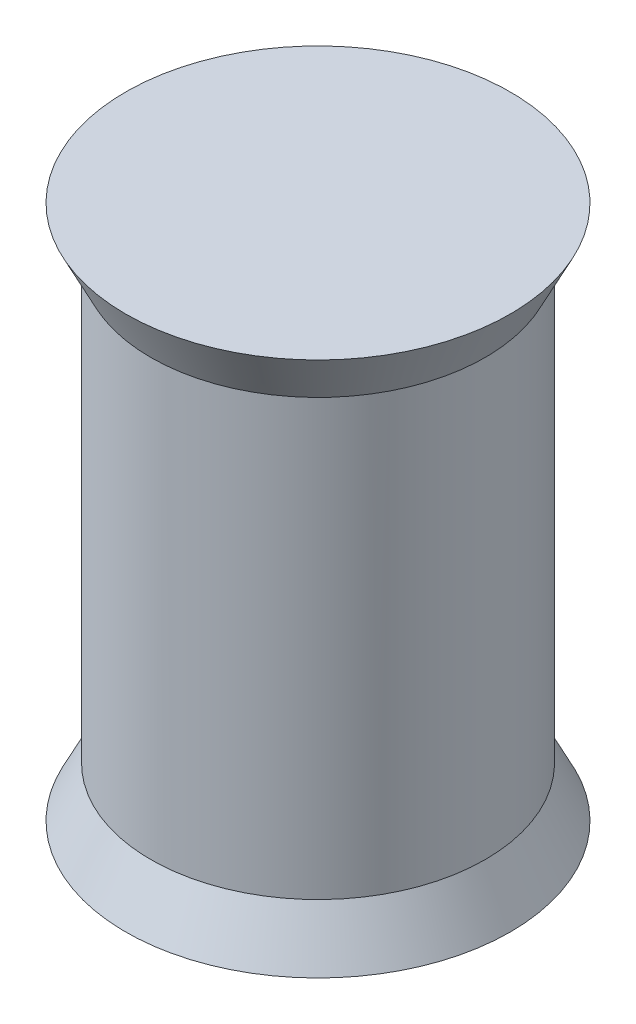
ISO-10303-21;
HEADER;
FILE_DESCRIPTION(('STEP AP214'),'2;1');
FILE_NAME('part.step','',(''),(''),'','','');
FILE_SCHEMA(('AUTOMOTIVE_DESIGN { 1 0 10303 214 1 1 1 1 }'));
ENDSEC;
DATA;
#1=APPLICATION_CONTEXT('core data for automotive mechanical design processes');
#2=APPLICATION_PROTOCOL_DEFINITION('international standard','automotive_design',2000,#1);
#3=PRODUCT_CONTEXT('',#1,'mechanical');
#4=PRODUCT('Part','Part','',(#3));
#5=PRODUCT_RELATED_PRODUCT_CATEGORY('part','',(#4));
#6=PRODUCT_DEFINITION_FORMATION('','',#4);
#7=PRODUCT_DEFINITION_CONTEXT('part definition',#1,'design');
#8=PRODUCT_DEFINITION('design','',#6,#7);
#9=PRODUCT_DEFINITION_SHAPE('','',#8);
#10=(LENGTH_UNIT() NAMED_UNIT(*) SI_UNIT(.MILLI.,.METRE.));
#11=(NAMED_UNIT(*) PLANE_ANGLE_UNIT() SI_UNIT($,.RADIAN.));
#12=(NAMED_UNIT(*) SI_UNIT($,.STERADIAN.) SOLID_ANGLE_UNIT());
#13=UNCERTAINTY_MEASURE_WITH_UNIT(LENGTH_MEASURE(1.E-05),#10,'distance_accuracy_value','');
#14=(GEOMETRIC_REPRESENTATION_CONTEXT(3) GLOBAL_UNCERTAINTY_ASSIGNED_CONTEXT((#13)) GLOBAL_UNIT_ASSIGNED_CONTEXT((#10,
#11,#12)) REPRESENTATION_CONTEXT('',''));
#15=CARTESIAN_POINT('',(0.,0.,0.));
#16=DIRECTION('',(0.,0.,1.));
#17=DIRECTION('',(1.,0.,0.));
#18=AXIS2_PLACEMENT_3D('',#15,#16,#17);
#19=CARTESIAN_POINT('',(-1.4375,4.,0.));
#20=DIRECTION('',(0.,1.,0.));
#21=DIRECTION('',(0.,0.,1.));
#22=AXIS2_PLACEMENT_3D('',#19,#20,#21);
#23=PLANE('',#22);
#24=CARTESIAN_POINT('',(0.,4.00000000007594,0.));
#25=DIRECTION('',(0.,1.,0.));
#26=DIRECTION('',(0.,0.,1.));
#27=AXIS2_PLACEMENT_3D('',#24,#25,#26);
#28=CIRCLE('',#27,2.87499999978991);
#29=CARTESIAN_POINT('',(0.,4.00000000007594,2.87499999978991));
#30=VERTEX_POINT('',#29);
#31=EDGE_CURVE('E17',#30,#30,#28,.F.);
#32=ORIENTED_EDGE('',*,*,#31,.F.);
#33=EDGE_LOOP('',(#32));
#34=FACE_BOUND('',#33,.T.);
#35=ADVANCED_FACE('F14',(#34),#23,.T.);
#36=CARTESIAN_POINT('',(-1.4375,-4.,0.));
#37=DIRECTION('',(0.,-1.,0.));
#38=DIRECTION('',(0.,0.,-1.));
#39=AXIS2_PLACEMENT_3D('',#36,#37,#38);
#40=PLANE('',#39);
#41=CARTESIAN_POINT('',(0.,-4.00000000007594,0.));
#42=DIRECTION('',(0.,-1.,0.));
#43=DIRECTION('',(1.,0.,0.));
#44=AXIS2_PLACEMENT_3D('',#41,#42,#43);
#45=CIRCLE('',#44,2.87499999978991);
#46=CARTESIAN_POINT('',(2.87499999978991,-4.00000000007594,0.));
#47=VERTEX_POINT('',#46);
#48=EDGE_CURVE('E26',#47,#47,#45,.F.);
#49=ORIENTED_EDGE('',*,*,#48,.F.);
#50=EDGE_LOOP('',(#49));
#51=FACE_BOUND('',#50,.T.);
#52=ADVANCED_FACE('F41',(#51),#40,.T.);
#53=CARTESIAN_POINT('',(0.,4.0000000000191,0.));
#54=DIRECTION('',(0.,1.,0.));
#55=DIRECTION('',(0.,0.,1.));
#56=AXIS2_PLACEMENT_3D('',#53,#54,#55);
#57=CONICAL_SURFACE('',#56,2.87499999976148,0.463647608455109);
#58=CARTESIAN_POINT('',(0.,3.25,0.));
#59=DIRECTION('',(0.,1.,0.));
#60=DIRECTION('',(-1.,0.,0.));
#61=AXIS2_PLACEMENT_3D('',#58,#59,#60);
#62=CIRCLE('',#61,2.5);
#63=CARTESIAN_POINT('',(-2.5,3.25,0.));
#64=VERTEX_POINT('',#63);
#65=EDGE_CURVE('E21',#64,#64,#62,.F.);
#66=ORIENTED_EDGE('',*,*,#65,.F.);
#67=EDGE_LOOP('',(#66));
#68=FACE_BOUND('',#67,.T.);
#69=ORIENTED_EDGE('',*,*,#31,.T.);
#70=EDGE_LOOP('',(#69));
#71=FACE_BOUND('',#70,.T.);
#72=ADVANCED_FACE('F38',(#68,#71),#57,.T.);
#73=CARTESIAN_POINT('',(0.,-3.99999999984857,0.));
#74=DIRECTION('',(0.,-1.,0.));
#75=DIRECTION('',(1.,0.,0.));
#76=AXIS2_PLACEMENT_3D('',#73,#74,#75);
#77=CONICAL_SURFACE('',#76,2.87499999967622,0.463647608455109);
#78=ORIENTED_EDGE('',*,*,#48,.T.);
#79=EDGE_LOOP('',(#78));
#80=FACE_BOUND('',#79,.T.);
#81=CARTESIAN_POINT('',(0.,-3.25,0.));
#82=DIRECTION('',(0.,1.,0.));
#83=DIRECTION('',(-1.,0.,0.));
#84=AXIS2_PLACEMENT_3D('',#81,#82,#83);
#85=CIRCLE('',#84,2.5);
#86=CARTESIAN_POINT('',(-2.5,-3.25,0.));
#87=VERTEX_POINT('',#86);
#88=EDGE_CURVE('E10',#87,#87,#85,.T.);
#89=ORIENTED_EDGE('',*,*,#88,.F.);
#90=EDGE_LOOP('',(#89));
#91=FACE_BOUND('',#90,.T.);
#92=ADVANCED_FACE('F49',(#80,#91),#77,.T.);
#93=CARTESIAN_POINT('',(0.,0.,0.));
#94=DIRECTION('',(0.,1.,0.));
#95=DIRECTION('',(-1.,0.,0.));
#96=AXIS2_PLACEMENT_3D('',#93,#94,#95);
#97=CYLINDRICAL_SURFACE('',#96,2.5);
#98=ORIENTED_EDGE('',*,*,#88,.T.);
#99=EDGE_LOOP('',(#98));
#100=FACE_BOUND('',#99,.T.);
#101=ORIENTED_EDGE('',*,*,#65,.T.);
#102=EDGE_LOOP('',(#101));
#103=FACE_BOUND('',#102,.T.);
#104=ADVANCED_FACE('F47',(#100,#103),#97,.T.);
#105=CLOSED_SHELL('',(#35,#52,#72,#92,#104));
#106=MANIFOLD_SOLID_BREP('B1',#105);
#107=ADVANCED_BREP_SHAPE_REPRESENTATION('',(#18,#106),#14);
#108=SHAPE_DEFINITION_REPRESENTATION(#9,#107);
ENDSEC;
END-ISO-10303-21;
